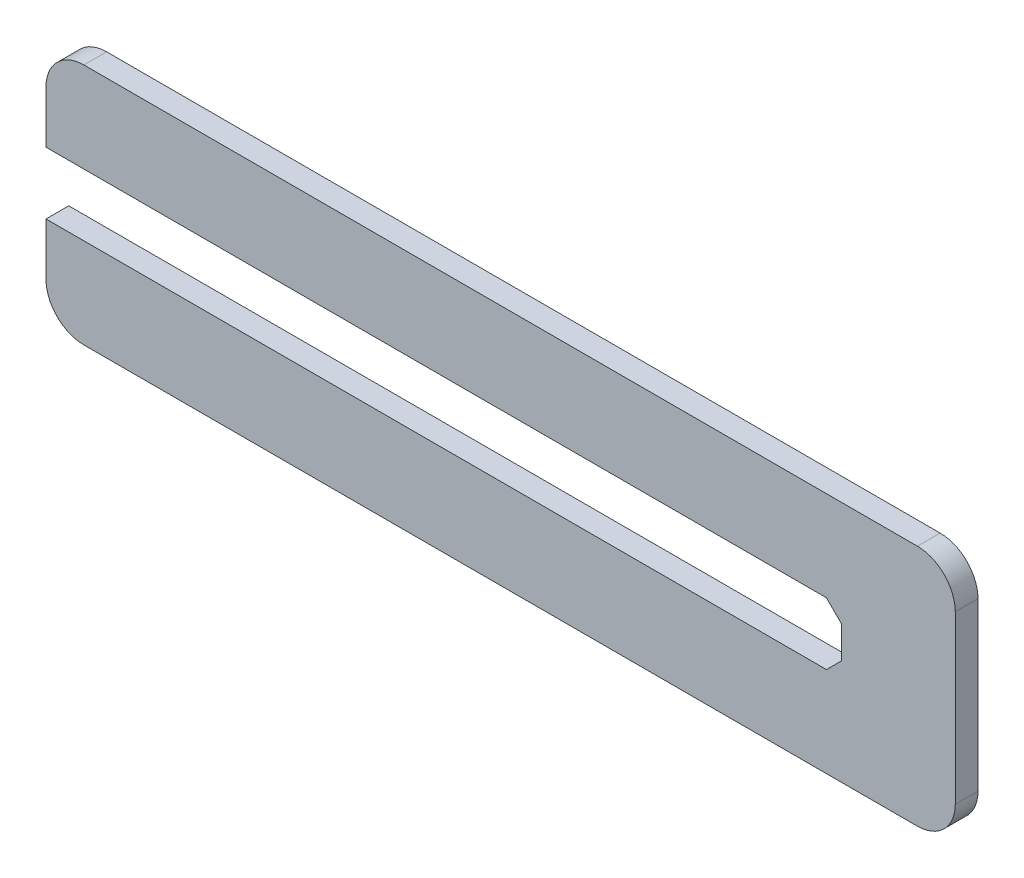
ISO-10303-21;
HEADER;
FILE_DESCRIPTION(('STEP AP214'),'2;1');
FILE_NAME('part.step','',(''),(''),'','','');
FILE_SCHEMA(('AUTOMOTIVE_DESIGN { 1 0 10303 214 1 1 1 1 }'));
ENDSEC;
DATA;
#1=APPLICATION_CONTEXT('core data for automotive mechanical design processes');
#2=APPLICATION_PROTOCOL_DEFINITION('international standard','automotive_design',2000,#1);
#3=PRODUCT_CONTEXT('',#1,'mechanical');
#4=PRODUCT('Part','Part','',(#3));
#5=PRODUCT_RELATED_PRODUCT_CATEGORY('part','',(#4));
#6=PRODUCT_DEFINITION_FORMATION('','',#4);
#7=PRODUCT_DEFINITION_CONTEXT('part definition',#1,'design');
#8=PRODUCT_DEFINITION('design','',#6,#7);
#9=PRODUCT_DEFINITION_SHAPE('','',#8);
#10=(LENGTH_UNIT() NAMED_UNIT(*) SI_UNIT(.MILLI.,.METRE.));
#11=(NAMED_UNIT(*) PLANE_ANGLE_UNIT() SI_UNIT($,.RADIAN.));
#12=(NAMED_UNIT(*) SI_UNIT($,.STERADIAN.) SOLID_ANGLE_UNIT());
#13=UNCERTAINTY_MEASURE_WITH_UNIT(LENGTH_MEASURE(1.E-05),#10,'distance_accuracy_value','');
#14=(GEOMETRIC_REPRESENTATION_CONTEXT(3) GLOBAL_UNCERTAINTY_ASSIGNED_CONTEXT((#13)) GLOBAL_UNIT_ASSIGNED_CONTEXT((#10,
#11,#12)) REPRESENTATION_CONTEXT('',''));
#15=CARTESIAN_POINT('',(0.,0.,0.));
#16=DIRECTION('',(0.,0.,1.));
#17=DIRECTION('',(1.,0.,0.));
#18=AXIS2_PLACEMENT_3D('',#15,#16,#17);
#19=CARTESIAN_POINT('',(0.,0.,3.));
#20=DIRECTION('',(1.,0.,0.));
#21=DIRECTION('',(0.,0.,-1.));
#22=AXIS2_PLACEMENT_3D('',#19,#20,#21);
#23=PLANE('',#22);
#24=DIRECTION('',(0.,-1.,0.));
#25=VECTOR('',#24,1.);
#26=CARTESIAN_POINT('',(0.,0.,3.));
#27=LINE('',#26,#25);
#28=CARTESIAN_POINT('',(0.,27.,3.));
#29=VERTEX_POINT('',#28);
#30=CARTESIAN_POINT('',(0.,20.1,3.));
#31=VERTEX_POINT('',#30);
#32=EDGE_CURVE('E235',#29,#31,#27,.T.);
#33=ORIENTED_EDGE('',*,*,#32,.F.);
#34=DIRECTION('',(0.,0.,-1.));
#35=VECTOR('',#34,1.);
#36=CARTESIAN_POINT('',(0.,27.,3.));
#37=LINE('',#36,#35);
#38=CARTESIAN_POINT('',(0.,27.,0.));
#39=VERTEX_POINT('',#38);
#40=EDGE_CURVE('E220',#29,#39,#37,.T.);
#41=ORIENTED_EDGE('',*,*,#40,.T.);
#42=DIRECTION('',(0.,-1.,0.));
#43=VECTOR('',#42,1.);
#44=CARTESIAN_POINT('',(0.,0.,0.));
#45=LINE('',#44,#43);
#46=CARTESIAN_POINT('',(0.,20.1,0.));
#47=VERTEX_POINT('',#46);
#48=EDGE_CURVE('E161',#39,#47,#45,.T.);
#49=ORIENTED_EDGE('',*,*,#48,.T.);
#50=DIRECTION('',(0.,0.,1.));
#51=VECTOR('',#50,1.);
#52=CARTESIAN_POINT('',(0.,20.1,0.));
#53=LINE('',#52,#51);
#54=EDGE_CURVE('E154',#47,#31,#53,.T.);
#55=ORIENTED_EDGE('',*,*,#54,.T.);
#56=EDGE_LOOP('',(#33,#41,#49,#55));
#57=FACE_BOUND('',#56,.T.);
#58=ADVANCED_FACE('F32',(#57),#23,.F.);
#59=CARTESIAN_POINT('',(0.,11.9,0.));
#60=VERTEX_POINT('',#59);
#61=CARTESIAN_POINT('',(0.,5.,0.));
#62=VERTEX_POINT('',#61);
#63=EDGE_CURVE('E150',#60,#62,#45,.T.);
#64=ORIENTED_EDGE('',*,*,#63,.T.);
#65=DIRECTION('',(0.,0.,-1.));
#66=VECTOR('',#65,1.);
#67=CARTESIAN_POINT('',(0.,5.,3.));
#68=LINE('',#67,#66);
#69=CARTESIAN_POINT('',(0.,5.,3.));
#70=VERTEX_POINT('',#69);
#71=EDGE_CURVE('E218',#62,#70,#68,.F.);
#72=ORIENTED_EDGE('',*,*,#71,.T.);
#73=CARTESIAN_POINT('',(0.,11.9,3.));
#74=VERTEX_POINT('',#73);
#75=EDGE_CURVE('E153',#74,#70,#27,.T.);
#76=ORIENTED_EDGE('',*,*,#75,.F.);
#77=DIRECTION('',(0.,0.,1.));
#78=VECTOR('',#77,1.);
#79=CARTESIAN_POINT('',(0.,11.9,0.));
#80=LINE('',#79,#78);
#81=EDGE_CURVE('E136',#60,#74,#80,.T.);
#82=ORIENTED_EDGE('',*,*,#81,.F.);
#83=EDGE_LOOP('',(#64,#72,#76,#82));
#84=FACE_BOUND('',#83,.T.);
#85=ADVANCED_FACE('F149',(#84),#23,.F.);
#86=CARTESIAN_POINT('',(0.,0.,3.));
#87=DIRECTION('',(0.,1.,0.));
#88=DIRECTION('',(0.,0.,1.));
#89=AXIS2_PLACEMENT_3D('',#86,#87,#88);
#90=PLANE('',#89);
#91=DIRECTION('',(1.,0.,0.));
#92=VECTOR('',#91,1.);
#93=CARTESIAN_POINT('',(0.,0.,0.));
#94=LINE('',#93,#92);
#95=CARTESIAN_POINT('',(5.,0.,0.));
#96=VERTEX_POINT('',#95);
#97=CARTESIAN_POINT('',(115.,0.,0.));
#98=VERTEX_POINT('',#97);
#99=EDGE_CURVE('E163',#96,#98,#94,.T.);
#100=ORIENTED_EDGE('',*,*,#99,.T.);
#101=DIRECTION('',(0.,0.,-1.));
#102=VECTOR('',#101,1.);
#103=CARTESIAN_POINT('',(115.,0.,3.));
#104=LINE('',#103,#102);
#105=CARTESIAN_POINT('',(115.,0.,3.));
#106=VERTEX_POINT('',#105);
#107=EDGE_CURVE('E209',#98,#106,#104,.F.);
#108=ORIENTED_EDGE('',*,*,#107,.T.);
#109=DIRECTION('',(1.,0.,0.));
#110=VECTOR('',#109,1.);
#111=CARTESIAN_POINT('',(0.,0.,3.));
#112=LINE('',#111,#110);
#113=CARTESIAN_POINT('',(5.,0.,3.));
#114=VERTEX_POINT('',#113);
#115=EDGE_CURVE('E239',#114,#106,#112,.T.);
#116=ORIENTED_EDGE('',*,*,#115,.F.);
#117=DIRECTION('',(0.,0.,-1.));
#118=VECTOR('',#117,1.);
#119=CARTESIAN_POINT('',(5.,0.,3.));
#120=LINE('',#119,#118);
#121=EDGE_CURVE('E206',#114,#96,#120,.T.);
#122=ORIENTED_EDGE('',*,*,#121,.T.);
#123=EDGE_LOOP('',(#100,#108,#116,#122));
#124=FACE_BOUND('',#123,.T.);
#125=ADVANCED_FACE('F264',(#124),#90,.F.);
#126=CARTESIAN_POINT('',(120.,0.,3.));
#127=DIRECTION('',(-1.,0.,0.));
#128=DIRECTION('',(0.,0.,1.));
#129=AXIS2_PLACEMENT_3D('',#126,#127,#128);
#130=PLANE('',#129);
#131=DIRECTION('',(0.,1.,0.));
#132=VECTOR('',#131,1.);
#133=CARTESIAN_POINT('',(120.,0.,3.));
#134=LINE('',#133,#132);
#135=CARTESIAN_POINT('',(120.,5.,3.));
#136=VERTEX_POINT('',#135);
#137=CARTESIAN_POINT('',(120.,27.,3.));
#138=VERTEX_POINT('',#137);
#139=EDGE_CURVE('E242',#136,#138,#134,.T.);
#140=ORIENTED_EDGE('',*,*,#139,.F.);
#141=DIRECTION('',(0.,0.,-1.));
#142=VECTOR('',#141,1.);
#143=CARTESIAN_POINT('',(120.,5.,3.));
#144=LINE('',#143,#142);
#145=CARTESIAN_POINT('',(120.,5.,0.));
#146=VERTEX_POINT('',#145);
#147=EDGE_CURVE('E196',#136,#146,#144,.T.);
#148=ORIENTED_EDGE('',*,*,#147,.T.);
#149=DIRECTION('',(0.,1.,0.));
#150=VECTOR('',#149,1.);
#151=CARTESIAN_POINT('',(120.,0.,0.));
#152=LINE('',#151,#150);
#153=CARTESIAN_POINT('',(120.,27.,0.));
#154=VERTEX_POINT('',#153);
#155=EDGE_CURVE('E172',#146,#154,#152,.T.);
#156=ORIENTED_EDGE('',*,*,#155,.T.);
#157=DIRECTION('',(0.,0.,-1.));
#158=VECTOR('',#157,1.);
#159=CARTESIAN_POINT('',(120.,27.,3.));
#160=LINE('',#159,#158);
#161=EDGE_CURVE('E194',#154,#138,#160,.F.);
#162=ORIENTED_EDGE('',*,*,#161,.T.);
#163=EDGE_LOOP('',(#140,#148,#156,#162));
#164=FACE_BOUND('',#163,.T.);
#165=ADVANCED_FACE('F256',(#164),#130,.F.);
#166=CARTESIAN_POINT('',(0.,32.,3.));
#167=DIRECTION('',(0.,-1.,0.));
#168=DIRECTION('',(0.,0.,-1.));
#169=AXIS2_PLACEMENT_3D('',#166,#167,#168);
#170=PLANE('',#169);
#171=DIRECTION('',(-1.,0.,0.));
#172=VECTOR('',#171,1.);
#173=CARTESIAN_POINT('',(0.,32.,0.));
#174=LINE('',#173,#172);
#175=CARTESIAN_POINT('',(115.,32.,0.));
#176=VERTEX_POINT('',#175);
#177=CARTESIAN_POINT('',(5.,32.,0.));
#178=VERTEX_POINT('',#177);
#179=EDGE_CURVE('E175',#176,#178,#174,.T.);
#180=ORIENTED_EDGE('',*,*,#179,.T.);
#181=DIRECTION('',(0.,0.,-1.));
#182=VECTOR('',#181,1.);
#183=CARTESIAN_POINT('',(5.,32.,3.));
#184=LINE('',#183,#182);
#185=CARTESIAN_POINT('',(5.,32.,3.));
#186=VERTEX_POINT('',#185);
#187=EDGE_CURVE('E11',#178,#186,#184,.F.);
#188=ORIENTED_EDGE('',*,*,#187,.T.);
#189=DIRECTION('',(-1.,0.,0.));
#190=VECTOR('',#189,1.);
#191=CARTESIAN_POINT('',(0.,32.,3.));
#192=LINE('',#191,#190);
#193=CARTESIAN_POINT('',(115.,32.,3.));
#194=VERTEX_POINT('',#193);
#195=EDGE_CURVE('E168',#194,#186,#192,.T.);
#196=ORIENTED_EDGE('',*,*,#195,.F.);
#197=DIRECTION('',(0.,0.,-1.));
#198=VECTOR('',#197,1.);
#199=CARTESIAN_POINT('',(115.,32.,3.));
#200=LINE('',#199,#198);
#201=EDGE_CURVE('E40',#194,#176,#200,.T.);
#202=ORIENTED_EDGE('',*,*,#201,.T.);
#203=EDGE_LOOP('',(#180,#188,#196,#202));
#204=FACE_BOUND('',#203,.T.);
#205=ADVANCED_FACE('F225',(#204),#170,.F.);
#206=CARTESIAN_POINT('',(0.,32.,3.));
#207=DIRECTION('',(0.,0.,-1.));
#208=DIRECTION('',(-1.,0.,0.));
#209=AXIS2_PLACEMENT_3D('',#206,#207,#208);
#210=PLANE('',#209);
#211=ORIENTED_EDGE('',*,*,#115,.T.);
#212=CARTESIAN_POINT('',(115.,5.,3.));
#213=DIRECTION('',(0.,0.,-1.));
#214=DIRECTION('',(-1.,0.,0.));
#215=AXIS2_PLACEMENT_3D('',#212,#213,#214);
#216=CIRCLE('',#215,5.);
#217=EDGE_CURVE('E216',#106,#136,#216,.F.);
#218=ORIENTED_EDGE('',*,*,#217,.T.);
#219=ORIENTED_EDGE('',*,*,#139,.T.);
#220=CARTESIAN_POINT('',(115.,27.,3.));
#221=DIRECTION('',(0.,0.,-1.));
#222=DIRECTION('',(-1.,0.,0.));
#223=AXIS2_PLACEMENT_3D('',#220,#221,#222);
#224=CIRCLE('',#223,5.);
#225=EDGE_CURVE('E52',#138,#194,#224,.F.);
#226=ORIENTED_EDGE('',*,*,#225,.T.);
#227=ORIENTED_EDGE('',*,*,#195,.T.);
#228=CARTESIAN_POINT('',(5.,27.,3.));
#229=DIRECTION('',(0.,0.,-1.));
#230=DIRECTION('',(-1.,0.,0.));
#231=AXIS2_PLACEMENT_3D('',#228,#229,#230);
#232=CIRCLE('',#231,5.);
#233=EDGE_CURVE('E212',#186,#29,#232,.F.);
#234=ORIENTED_EDGE('',*,*,#233,.T.);
#235=ORIENTED_EDGE('',*,*,#32,.T.);
#236=DIRECTION('',(-1.,0.,0.));
#237=VECTOR('',#236,1.);
#238=CARTESIAN_POINT('',(0.,20.1,3.));
#239=LINE('',#238,#237);
#240=CARTESIAN_POINT('',(103.,20.1,3.));
#241=VERTEX_POINT('',#240);
#242=EDGE_CURVE('E144',#241,#31,#239,.T.);
#243=ORIENTED_EDGE('',*,*,#242,.F.);
#244=DIRECTION('',(-0.707106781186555,0.70710678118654,0.));
#245=VECTOR('',#244,1.);
#246=CARTESIAN_POINT('',(45.5499999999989,77.5499999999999,3.));
#247=LINE('',#246,#245);
#248=CARTESIAN_POINT('',(105.,18.1,3.));
#249=VERTEX_POINT('',#248);
#250=EDGE_CURVE('E186',#241,#249,#247,.F.);
#251=ORIENTED_EDGE('',*,*,#250,.T.);
#252=DIRECTION('',(0.,1.,0.));
#253=VECTOR('',#252,1.);
#254=CARTESIAN_POINT('',(105.,20.1,3.));
#255=LINE('',#254,#253);
#256=CARTESIAN_POINT('',(105.,13.9,3.));
#257=VERTEX_POINT('',#256);
#258=EDGE_CURVE('E298',#257,#249,#255,.T.);
#259=ORIENTED_EDGE('',*,*,#258,.F.);
#260=DIRECTION('',(0.707106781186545,0.70710678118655,0.));
#261=VECTOR('',#260,1.);
#262=CARTESIAN_POINT('',(61.5500000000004,-29.5499999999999,3.));
#263=LINE('',#262,#261);
#264=CARTESIAN_POINT('',(103.,11.9,3.));
#265=VERTEX_POINT('',#264);
#266=EDGE_CURVE('E190',#257,#265,#263,.F.);
#267=ORIENTED_EDGE('',*,*,#266,.T.);
#268=DIRECTION('',(1.,0.,0.));
#269=VECTOR('',#268,1.);
#270=CARTESIAN_POINT('',(0.,11.9,3.));
#271=LINE('',#270,#269);
#272=EDGE_CURVE('E296',#74,#265,#271,.T.);
#273=ORIENTED_EDGE('',*,*,#272,.F.);
#274=ORIENTED_EDGE('',*,*,#75,.T.);
#275=CARTESIAN_POINT('',(5.,5.,3.));
#276=DIRECTION('',(0.,0.,-1.));
#277=DIRECTION('',(-1.,0.,0.));
#278=AXIS2_PLACEMENT_3D('',#275,#276,#277);
#279=CIRCLE('',#278,5.);
#280=EDGE_CURVE('E214',#70,#114,#279,.F.);
#281=ORIENTED_EDGE('',*,*,#280,.T.);
#282=EDGE_LOOP('',(#211,#218,#219,#226,#227,#234,#235,#243,#251,#259,#267,#273,#274,#281));
#283=FACE_BOUND('',#282,.T.);
#284=ADVANCED_FACE('F245',(#283),#210,.F.);
#285=CARTESIAN_POINT('',(0.,32.,0.));
#286=DIRECTION('',(0.,0.,-1.));
#287=DIRECTION('',(-1.,0.,0.));
#288=AXIS2_PLACEMENT_3D('',#285,#286,#287);
#289=PLANE('',#288);
#290=ORIENTED_EDGE('',*,*,#155,.F.);
#291=CARTESIAN_POINT('',(115.,5.,0.));
#292=DIRECTION('',(0.,0.,-1.));
#293=DIRECTION('',(-1.,0.,0.));
#294=AXIS2_PLACEMENT_3D('',#291,#292,#293);
#295=CIRCLE('',#294,5.);
#296=EDGE_CURVE('E204',#146,#98,#295,.T.);
#297=ORIENTED_EDGE('',*,*,#296,.T.);
#298=ORIENTED_EDGE('',*,*,#99,.F.);
#299=CARTESIAN_POINT('',(5.,5.,0.));
#300=DIRECTION('',(0.,0.,-1.));
#301=DIRECTION('',(-1.,0.,0.));
#302=AXIS2_PLACEMENT_3D('',#299,#300,#301);
#303=CIRCLE('',#302,5.);
#304=EDGE_CURVE('E160',#96,#62,#303,.T.);
#305=ORIENTED_EDGE('',*,*,#304,.T.);
#306=ORIENTED_EDGE('',*,*,#63,.F.);
#307=DIRECTION('',(1.,0.,0.));
#308=VECTOR('',#307,1.);
#309=CARTESIAN_POINT('',(0.,11.9,0.));
#310=LINE('',#309,#308);
#311=CARTESIAN_POINT('',(103.,11.9,0.));
#312=VERTEX_POINT('',#311);
#313=EDGE_CURVE('E132',#60,#312,#310,.T.);
#314=ORIENTED_EDGE('',*,*,#313,.T.);
#315=DIRECTION('',(-0.707106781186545,-0.70710678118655,0.));
#316=VECTOR('',#315,1.);
#317=CARTESIAN_POINT('',(105.,13.9,0.));
#318=LINE('',#317,#316);
#319=CARTESIAN_POINT('',(105.,13.9,0.));
#320=VERTEX_POINT('',#319);
#321=EDGE_CURVE('E192',#312,#320,#318,.F.);
#322=ORIENTED_EDGE('',*,*,#321,.T.);
#323=DIRECTION('',(0.,1.,0.));
#324=VECTOR('',#323,1.);
#325=CARTESIAN_POINT('',(105.,20.1,0.));
#326=LINE('',#325,#324);
#327=CARTESIAN_POINT('',(105.,18.1,0.));
#328=VERTEX_POINT('',#327);
#329=EDGE_CURVE('E143',#320,#328,#326,.T.);
#330=ORIENTED_EDGE('',*,*,#329,.T.);
#331=DIRECTION('',(0.707106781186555,-0.70710678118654,0.));
#332=VECTOR('',#331,1.);
#333=CARTESIAN_POINT('',(103.,20.1,0.));
#334=LINE('',#333,#332);
#335=CARTESIAN_POINT('',(103.,20.1,0.));
#336=VERTEX_POINT('',#335);
#337=EDGE_CURVE('E188',#328,#336,#334,.F.);
#338=ORIENTED_EDGE('',*,*,#337,.T.);
#339=DIRECTION('',(-1.,0.,0.));
#340=VECTOR('',#339,1.);
#341=CARTESIAN_POINT('',(0.,20.1,0.));
#342=LINE('',#341,#340);
#343=EDGE_CURVE('E155',#336,#47,#342,.T.);
#344=ORIENTED_EDGE('',*,*,#343,.T.);
#345=ORIENTED_EDGE('',*,*,#48,.F.);
#346=CARTESIAN_POINT('',(5.,27.,0.));
#347=DIRECTION('',(0.,0.,-1.));
#348=DIRECTION('',(-1.,0.,0.));
#349=AXIS2_PLACEMENT_3D('',#346,#347,#348);
#350=CIRCLE('',#349,5.);
#351=EDGE_CURVE('E201',#39,#178,#350,.T.);
#352=ORIENTED_EDGE('',*,*,#351,.T.);
#353=ORIENTED_EDGE('',*,*,#179,.F.);
#354=CARTESIAN_POINT('',(115.,27.,0.));
#355=DIRECTION('',(0.,0.,-1.));
#356=DIRECTION('',(-1.,0.,0.));
#357=AXIS2_PLACEMENT_3D('',#354,#355,#356);
#358=CIRCLE('',#357,5.);
#359=EDGE_CURVE('E199',#176,#154,#358,.T.);
#360=ORIENTED_EDGE('',*,*,#359,.T.);
#361=EDGE_LOOP('',(#290,#297,#298,#305,#306,#314,#322,#330,#338,#344,#345,#352,#353,#360));
#362=FACE_BOUND('',#361,.T.);
#363=ADVANCED_FACE('F158',(#362),#289,.T.);
#364=CARTESIAN_POINT('',(0.,20.1,0.));
#365=DIRECTION('',(0.,1.,0.));
#366=DIRECTION('',(0.,0.,1.));
#367=AXIS2_PLACEMENT_3D('',#364,#365,#366);
#368=PLANE('',#367);
#369=ORIENTED_EDGE('',*,*,#343,.F.);
#370=DIRECTION('',(0.,0.,1.));
#371=VECTOR('',#370,1.);
#372=CARTESIAN_POINT('',(103.,20.1,3.));
#373=LINE('',#372,#371);
#374=EDGE_CURVE('E177',#336,#241,#373,.T.);
#375=ORIENTED_EDGE('',*,*,#374,.T.);
#376=ORIENTED_EDGE('',*,*,#242,.T.);
#377=ORIENTED_EDGE('',*,*,#54,.F.);
#378=EDGE_LOOP('',(#369,#375,#376,#377));
#379=FACE_BOUND('',#378,.T.);
#380=ADVANCED_FACE('F254',(#379),#368,.F.);
#381=CARTESIAN_POINT('',(105.,20.1,0.));
#382=DIRECTION('',(1.,0.,0.));
#383=DIRECTION('',(0.,0.,-1.));
#384=AXIS2_PLACEMENT_3D('',#381,#382,#383);
#385=PLANE('',#384);
#386=ORIENTED_EDGE('',*,*,#258,.T.);
#387=DIRECTION('',(0.,0.,-1.));
#388=VECTOR('',#387,1.);
#389=CARTESIAN_POINT('',(105.,18.1,0.));
#390=LINE('',#389,#388);
#391=EDGE_CURVE('E183',#249,#328,#390,.T.);
#392=ORIENTED_EDGE('',*,*,#391,.T.);
#393=ORIENTED_EDGE('',*,*,#329,.F.);
#394=DIRECTION('',(0.,0.,1.));
#395=VECTOR('',#394,1.);
#396=CARTESIAN_POINT('',(105.,13.9,3.));
#397=LINE('',#396,#395);
#398=EDGE_CURVE('E180',#320,#257,#397,.T.);
#399=ORIENTED_EDGE('',*,*,#398,.T.);
#400=EDGE_LOOP('',(#386,#392,#393,#399));
#401=FACE_BOUND('',#400,.T.);
#402=ADVANCED_FACE('F310',(#401),#385,.F.);
#403=CARTESIAN_POINT('',(0.,11.9,0.));
#404=DIRECTION('',(0.,-1.,0.));
#405=DIRECTION('',(0.,0.,-1.));
#406=AXIS2_PLACEMENT_3D('',#403,#404,#405);
#407=PLANE('',#406);
#408=ORIENTED_EDGE('',*,*,#272,.T.);
#409=DIRECTION('',(0.,0.,-1.));
#410=VECTOR('',#409,1.);
#411=CARTESIAN_POINT('',(103.,11.9,0.));
#412=LINE('',#411,#410);
#413=EDGE_CURVE('E139',#265,#312,#412,.T.);
#414=ORIENTED_EDGE('',*,*,#413,.T.);
#415=ORIENTED_EDGE('',*,*,#313,.F.);
#416=ORIENTED_EDGE('',*,*,#81,.T.);
#417=EDGE_LOOP('',(#408,#414,#415,#416));
#418=FACE_BOUND('',#417,.T.);
#419=ADVANCED_FACE('F135',(#418),#407,.F.);
#420=CARTESIAN_POINT('',(103.,20.1,0.));
#421=DIRECTION('',(-0.70710678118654,-0.707106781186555,0.));
#422=DIRECTION('',(0.707106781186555,-0.70710678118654,0.));
#423=AXIS2_PLACEMENT_3D('',#420,#421,#422);
#424=PLANE('',#423);
#425=ORIENTED_EDGE('',*,*,#337,.F.);
#426=ORIENTED_EDGE('',*,*,#391,.F.);
#427=ORIENTED_EDGE('',*,*,#250,.F.);
#428=ORIENTED_EDGE('',*,*,#374,.F.);
#429=EDGE_LOOP('',(#425,#426,#427,#428));
#430=FACE_BOUND('',#429,.T.);
#431=ADVANCED_FACE('F268',(#430),#424,.T.);
#432=CARTESIAN_POINT('',(105.,13.9,0.));
#433=DIRECTION('',(-0.70710678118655,0.707106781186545,0.));
#434=DIRECTION('',(-0.707106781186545,-0.70710678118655,0.));
#435=AXIS2_PLACEMENT_3D('',#432,#433,#434);
#436=PLANE('',#435);
#437=ORIENTED_EDGE('',*,*,#321,.F.);
#438=ORIENTED_EDGE('',*,*,#413,.F.);
#439=ORIENTED_EDGE('',*,*,#266,.F.);
#440=ORIENTED_EDGE('',*,*,#398,.F.);
#441=EDGE_LOOP('',(#437,#438,#439,#440));
#442=FACE_BOUND('',#441,.T.);
#443=ADVANCED_FACE('F271',(#442),#436,.T.);
#444=CARTESIAN_POINT('',(115.,5.,3.));
#445=DIRECTION('',(0.,0.,-1.));
#446=DIRECTION('',(-1.,0.,0.));
#447=AXIS2_PLACEMENT_3D('',#444,#445,#446);
#448=CYLINDRICAL_SURFACE('',#447,5.);
#449=ORIENTED_EDGE('',*,*,#217,.F.);
#450=ORIENTED_EDGE('',*,*,#107,.F.);
#451=ORIENTED_EDGE('',*,*,#296,.F.);
#452=ORIENTED_EDGE('',*,*,#147,.F.);
#453=EDGE_LOOP('',(#449,#450,#451,#452));
#454=FACE_BOUND('',#453,.T.);
#455=ADVANCED_FACE('F275',(#454),#448,.T.);
#456=CARTESIAN_POINT('',(5.,5.,3.));
#457=DIRECTION('',(0.,0.,-1.));
#458=DIRECTION('',(-1.,0.,0.));
#459=AXIS2_PLACEMENT_3D('',#456,#457,#458);
#460=CYLINDRICAL_SURFACE('',#459,5.);
#461=ORIENTED_EDGE('',*,*,#280,.F.);
#462=ORIENTED_EDGE('',*,*,#71,.F.);
#463=ORIENTED_EDGE('',*,*,#304,.F.);
#464=ORIENTED_EDGE('',*,*,#121,.F.);
#465=EDGE_LOOP('',(#461,#462,#463,#464));
#466=FACE_BOUND('',#465,.T.);
#467=ADVANCED_FACE('F279',(#466),#460,.T.);
#468=CARTESIAN_POINT('',(5.,27.,3.));
#469=DIRECTION('',(0.,0.,-1.));
#470=DIRECTION('',(-1.,0.,0.));
#471=AXIS2_PLACEMENT_3D('',#468,#469,#470);
#472=CYLINDRICAL_SURFACE('',#471,5.);
#473=ORIENTED_EDGE('',*,*,#233,.F.);
#474=ORIENTED_EDGE('',*,*,#187,.F.);
#475=ORIENTED_EDGE('',*,*,#351,.F.);
#476=ORIENTED_EDGE('',*,*,#40,.F.);
#477=EDGE_LOOP('',(#473,#474,#475,#476));
#478=FACE_BOUND('',#477,.T.);
#479=ADVANCED_FACE('F232',(#478),#472,.T.);
#480=CARTESIAN_POINT('',(115.,27.,3.));
#481=DIRECTION('',(0.,0.,-1.));
#482=DIRECTION('',(-1.,0.,0.));
#483=AXIS2_PLACEMENT_3D('',#480,#481,#482);
#484=CYLINDRICAL_SURFACE('',#483,5.);
#485=ORIENTED_EDGE('',*,*,#225,.F.);
#486=ORIENTED_EDGE('',*,*,#161,.F.);
#487=ORIENTED_EDGE('',*,*,#359,.F.);
#488=ORIENTED_EDGE('',*,*,#201,.F.);
#489=EDGE_LOOP('',(#485,#486,#487,#488));
#490=FACE_BOUND('',#489,.T.);
#491=ADVANCED_FACE('F34',(#490),#484,.T.);
#492=CLOSED_SHELL('',(#58,#85,#125,#165,#205,#284,#363,#380,#402,#419,#431,#443,#455,#467,#479,#491));
#493=MANIFOLD_SOLID_BREP('B2',#492);
#494=ADVANCED_BREP_SHAPE_REPRESENTATION('',(#18,#493),#14);
#495=SHAPE_DEFINITION_REPRESENTATION(#9,#494);
ENDSEC;
END-ISO-10303-21;
